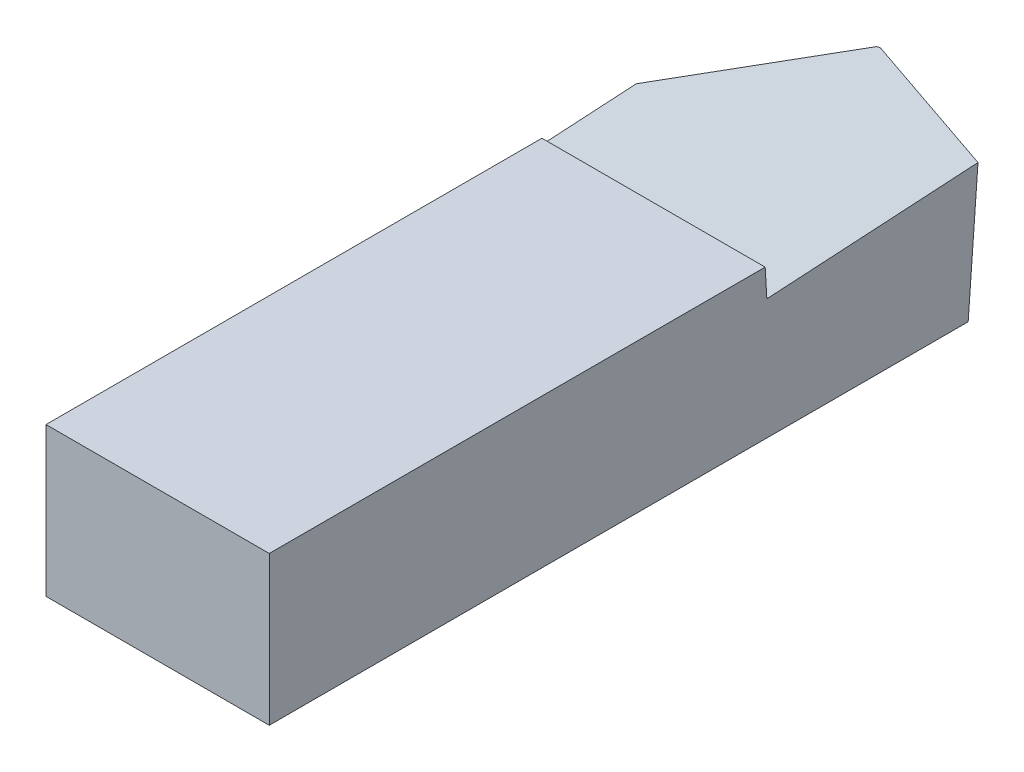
from build123d import *

# Parameters (mm, degrees)
SKETCH7_W           = 30
SKETCH7_H           = 20
BOSS_EXTRUDE2_DEPTH = 100
SKETCH11_W          = 111.319190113
SKETCH11_H          = 87.870250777
CUT_EXTRUDE3_DEPTH  = 70
SKETCH12_W          = 113.883796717
SKETCH12_H          = 127.364680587
CUT_EXTRUDE4_DEPTH  = 70
SKETCH13_W          = 106.979487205
SKETCH13_H          = 76.430513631
CUT_EXTRUDE5_DEPTH  = 70
FILLET1_R           = 0.492125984


with BuildPart() as part:
    # Sketch7 → Boss-Extrude2 (new body)
    with BuildSketch(Plane.XY):
        with Locations((3.058738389, -10)):
            Rectangle(SKETCH7_W, SKETCH7_H)
    extrude(amount=BOSS_EXTRUDE2_DEPTH)

    # Sketch11 → Cut-Extrude3 (cut)
    with BuildSketch(Plane(origin=(0, 0, 0), x_dir=(-0.9691668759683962, -0.018135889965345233, -0.24573696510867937), z_dir=(0.24640528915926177, -0.071332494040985, -0.9665382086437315))):
        with Locations((-10.807083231, -20.072115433)):
            Rectangle(SKETCH11_W, SKETCH11_H)
    extrude(amount=CUT_EXTRUDE3_DEPTH, mode=Mode.SUBTRACT)

    # Sketch12 → Cut-Extrude4 (cut)
    with BuildSketch(Plane(origin=(0, 0, 0), x_dir=(-0.48569913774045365, -0.08910953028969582, 0.8695722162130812), z_dir=(-0.855296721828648, -0.15691831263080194, -0.49380579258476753))):
        with Locations((15.537811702, -2.101317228)):
            Rectangle(SKETCH12_W, SKETCH12_H)
    extrude(amount=CUT_EXTRUDE4_DEPTH, mode=Mode.SUBTRACT)

    # Sketch13 → Cut-Extrude5 (cut)
    with BuildSketch(Plane(origin=(0, 0, 0), x_dir=(0.9948303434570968, -0.10137439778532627, -0.005984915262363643), z_dir=(0.10155091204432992, 0.9931011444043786, 0.058630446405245))):
        with Locations((11.35746681, 4.912702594)):
            Rectangle(SKETCH13_W, SKETCH13_H)
    extrude(amount=CUT_EXTRUDE5_DEPTH, mode=Mode.SUBTRACT)

    # Fillet1
    fillet1_edges = [part.edges().sort_by_distance(p)[0] for p in [
        (1.227845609, -10, 1.051042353),
    ]]
    fillet(fillet1_edges, radius=FILLET1_R)


solid = part.part
